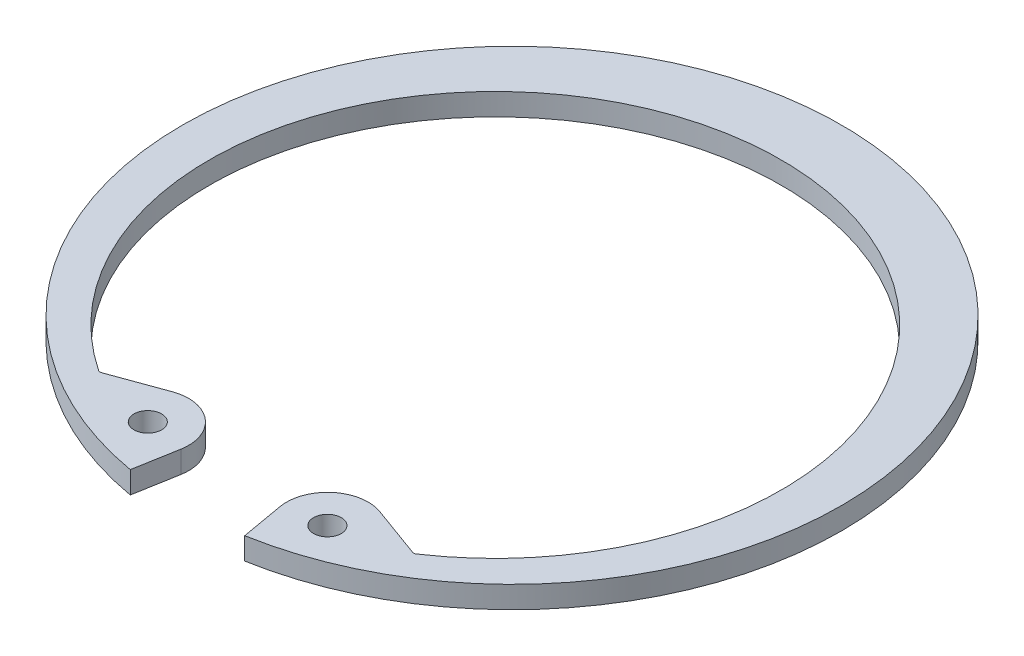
from build123d import *

# Parameters (mm, degrees)
SKETCH2_R      = 0.9906
EXTRUDE1_DEPTH = 1.5748
FILLET1_R      = 0.254


with BuildPart() as part:
    # Sketch2 → Extrude1 (new body)
    with BuildSketch(Plane(origin=(0, 0, 0), x_dir=(1, 0, 0), z_dir=(0, 1, 0))):
        with BuildLine():
            Line((4.097506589, -23.238114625), (3.5542698, -20.157265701))
            ThreePointArc((3.5542698, -20.157265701), (4.553310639, -17.412423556), (7.429934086, -16.905197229))
            Line((7.429934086, -16.905197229), (11.262846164, -18.300263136))
            ThreePointArc((11.262846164, -18.300263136), (0, 19.2786), (-11.262846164, -18.300263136))
            Line((-11.262846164, -18.300263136), (-7.429934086, -16.905197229))
            ThreePointArc((-7.429934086, -16.905197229), (-4.553310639, -17.412423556), (-3.5542698, -20.157265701))
            Line((-3.5542698, -20.157265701), (-4.097506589, -23.238114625))
            ThreePointArc((-4.097506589, -23.238114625), (0, 23.5966), (4.097506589, -23.238114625))
        make_face()
        with Locations(Location((6.430893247, -19.650039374, 0), (0, 0, 270))):
            Circle(SKETCH2_R, mode=Mode.SUBTRACT)
        with Locations(Location((-6.430893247, -19.650039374, 0), (0, 0, 270))):
            Circle(SKETCH2_R, mode=Mode.SUBTRACT)
    extrude(amount=-EXTRUDE1_DEPTH)

    # Fillet1
    fillet1_edges = [part.edges().sort_by_distance(p)[0] for p in [
        (11.262846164, -0.7874, 18.300263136),
        (-11.262846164, -0.7874, 18.300263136),
    ]]
    fillet(fillet1_edges, radius=FILLET1_R)


solid = part.part
